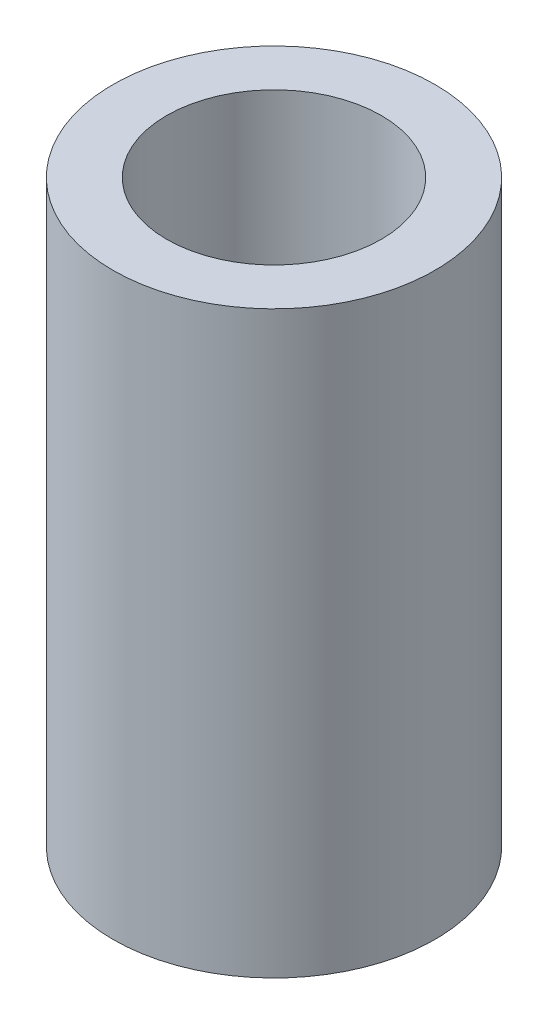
from build123d import *

# Parameters (mm, degrees)
SKETCH1_R           = 9.525
SKETCH1_R_2         = 6.35
BOSS_EXTRUDE1_DEPTH = 34.29


with BuildPart() as part:
    # Sketch1 → Boss-Extrude1 (new body)
    with BuildSketch(Plane(origin=(0, 0, 0), x_dir=(1, 0, 0), z_dir=(0, 1, 0))):
        with Locations(Location((0, 0, 0), (0, 0, 270))):
            Circle(SKETCH1_R)
        with Locations(Location((0, 0, 0), (0, 0, 270))):
            Circle(SKETCH1_R_2, mode=Mode.SUBTRACT)
    extrude(amount=BOSS_EXTRUDE1_DEPTH)


solid = part.part
